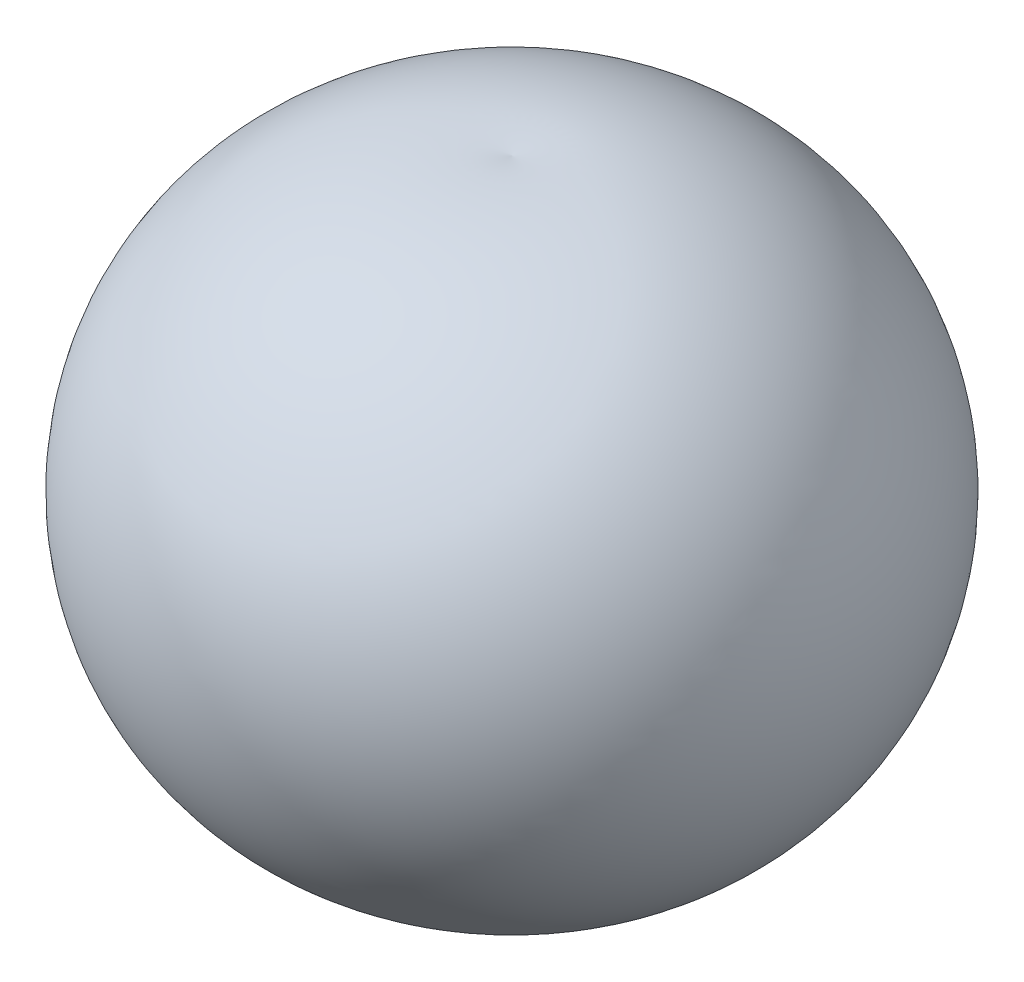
from build123d import *


with BuildPart() as part:
    # Sketch 1 → Revolve 1 (revolve)
    with BuildSketch(Plane(origin=(0, 0, 0), x_dir=(0, 0, -1), z_dir=(1, 0, 0))):
        with BuildLine():
            Line((0, 2629.091139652), (0, 1646.559633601))
            ThreePointArc((0, 1646.559633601), (-461.850673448, 1655.42253611), (-880.306469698, 1459.771463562))
            ThreePointArc((-880.306469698, 1459.771463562), (-816.579239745, 975.715094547), (-554.251693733, 563.943329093))
            ThreePointArc((-554.251693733, 563.943329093), (-308.53434817, 344.266299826), (0, 460.204072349))
            Line((0, 460.204072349), (0, -895.787433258))
            ThreePointArc((0, -895.787433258), (-682.044744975, -1173.681557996), (-1390.197745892, -971.371138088))
            ThreePointArc((-1390.197745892, -971.371138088), (-2104.439311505, 1373.029540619), (0, 2629.091139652))
        make_face()
    revolve(axis=Axis((0, 2948.37543573, 0), (0, -1, 0)))


solid = part.part
